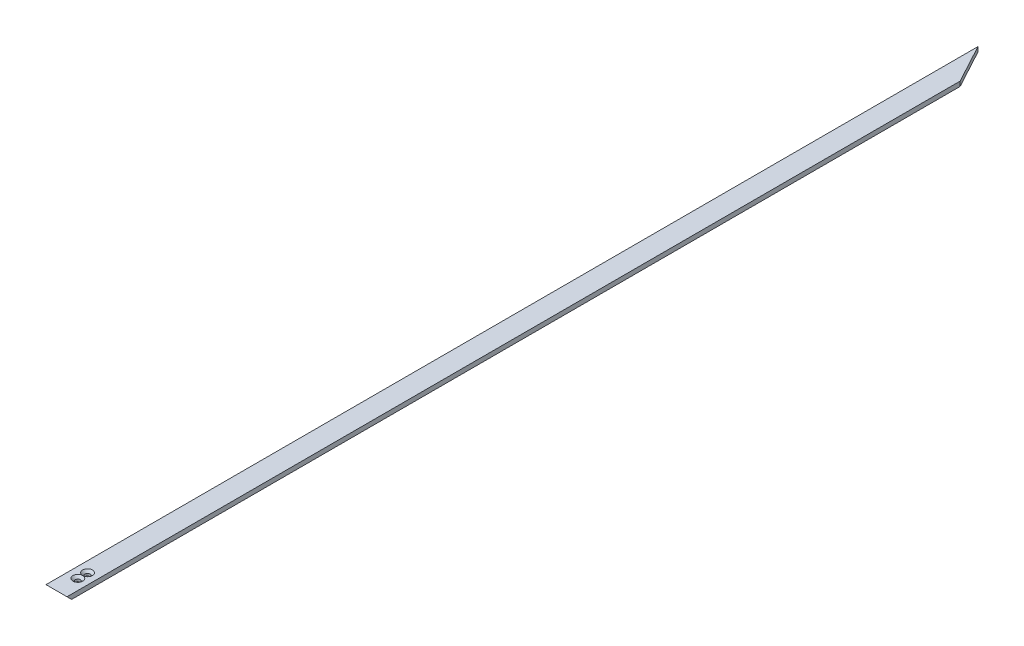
ISO-10303-21;
HEADER;
FILE_DESCRIPTION(('STEP AP214'),'2;1');
FILE_NAME('part.step','',(''),(''),'','','');
FILE_SCHEMA(('AUTOMOTIVE_DESIGN { 1 0 10303 214 1 1 1 1 }'));
ENDSEC;
DATA;
#1=APPLICATION_CONTEXT('core data for automotive mechanical design processes');
#2=APPLICATION_PROTOCOL_DEFINITION('international standard','automotive_design',2000,#1);
#3=PRODUCT_CONTEXT('',#1,'mechanical');
#4=PRODUCT('Part','Part','',(#3));
#5=PRODUCT_RELATED_PRODUCT_CATEGORY('part','',(#4));
#6=PRODUCT_DEFINITION_FORMATION('','',#4);
#7=PRODUCT_DEFINITION_CONTEXT('part definition',#1,'design');
#8=PRODUCT_DEFINITION('design','',#6,#7);
#9=PRODUCT_DEFINITION_SHAPE('','',#8);
#10=(LENGTH_UNIT() NAMED_UNIT(*) SI_UNIT(.MILLI.,.METRE.));
#11=(NAMED_UNIT(*) PLANE_ANGLE_UNIT() SI_UNIT($,.RADIAN.));
#12=(NAMED_UNIT(*) SI_UNIT($,.STERADIAN.) SOLID_ANGLE_UNIT());
#13=UNCERTAINTY_MEASURE_WITH_UNIT(LENGTH_MEASURE(1.E-05),#10,'distance_accuracy_value','');
#14=(GEOMETRIC_REPRESENTATION_CONTEXT(3) GLOBAL_UNCERTAINTY_ASSIGNED_CONTEXT((#13)) GLOBAL_UNIT_ASSIGNED_CONTEXT((#10,
#11,#12)) REPRESENTATION_CONTEXT('',''));
#15=CARTESIAN_POINT('',(0.,0.,0.));
#16=DIRECTION('',(0.,0.,1.));
#17=DIRECTION('',(1.,0.,0.));
#18=AXIS2_PLACEMENT_3D('',#15,#16,#17);
#19=CARTESIAN_POINT('',(-13.5,0.,600.));
#20=DIRECTION('',(1.,0.,0.));
#21=DIRECTION('',(0.,0.,-1.));
#22=AXIS2_PLACEMENT_3D('',#19,#20,#21);
#23=PLANE('',#22);
#24=DIRECTION('',(0.,0.,-1.));
#25=VECTOR('',#24,1.);
#26=CARTESIAN_POINT('',(-13.5,0.,600.));
#27=LINE('',#26,#25);
#28=CARTESIAN_POINT('',(-13.5,0.,594.));
#29=VERTEX_POINT('',#28);
#30=CARTESIAN_POINT('',(-13.5,0.,-600.));
#31=VERTEX_POINT('',#30);
#32=EDGE_CURVE('E124',#29,#31,#27,.T.);
#33=ORIENTED_EDGE('',*,*,#32,.F.);
#34=DIRECTION('',(0.,-0.707106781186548,-0.707106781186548));
#35=VECTOR('',#34,1.);
#36=CARTESIAN_POINT('',(-13.5,6.00000000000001,600.));
#37=LINE('',#36,#35);
#38=CARTESIAN_POINT('',(-13.5,6.,600.));
#39=VERTEX_POINT('',#38);
#40=EDGE_CURVE('E133',#29,#39,#37,.F.);
#41=ORIENTED_EDGE('',*,*,#40,.T.);
#42=DIRECTION('',(0.,0.,-1.));
#43=VECTOR('',#42,1.);
#44=CARTESIAN_POINT('',(-13.5,6.,600.));
#45=LINE('',#44,#43);
#46=CARTESIAN_POINT('',(-13.5,6.,-600.));
#47=VERTEX_POINT('',#46);
#48=EDGE_CURVE('E113',#39,#47,#45,.T.);
#49=ORIENTED_EDGE('',*,*,#48,.T.);
#50=DIRECTION('',(0.,-1.,0.));
#51=VECTOR('',#50,1.);
#52=CARTESIAN_POINT('',(-13.5,0.,-600.));
#53=LINE('',#52,#51);
#54=EDGE_CURVE('E98',#47,#31,#53,.T.);
#55=ORIENTED_EDGE('',*,*,#54,.T.);
#56=EDGE_LOOP('',(#33,#41,#49,#55));
#57=FACE_BOUND('',#56,.T.);
#58=ADVANCED_FACE('F36',(#57),#23,.F.);
#59=CARTESIAN_POINT('',(-13.5,0.,600.));
#60=DIRECTION('',(0.,1.,0.));
#61=DIRECTION('',(0.,0.,1.));
#62=AXIS2_PLACEMENT_3D('',#59,#60,#61);
#63=PLANE('',#62);
#64=CARTESIAN_POINT('',(0.,0.,572.5));
#65=DIRECTION('',(0.,1.,0.));
#66=DIRECTION('',(0.,0.,1.));
#67=AXIS2_PLACEMENT_3D('',#64,#65,#66);
#68=CIRCLE('',#67,3.25);
#69=CARTESIAN_POINT('',(0.,0.,575.75));
#70=VERTEX_POINT('',#69);
#71=EDGE_CURVE('E179',#70,#70,#68,.T.);
#72=ORIENTED_EDGE('',*,*,#71,.T.);
#73=EDGE_LOOP('',(#72));
#74=FACE_BOUND('',#73,.T.);
#75=CARTESIAN_POINT('',(0.,0.,560.));
#76=DIRECTION('',(0.,1.,0.));
#77=DIRECTION('',(0.,0.,1.));
#78=AXIS2_PLACEMENT_3D('',#75,#76,#77);
#79=CIRCLE('',#78,3.25);
#80=CARTESIAN_POINT('',(0.,0.,563.25));
#81=VERTEX_POINT('',#80);
#82=EDGE_CURVE('E93',#81,#81,#79,.T.);
#83=ORIENTED_EDGE('',*,*,#82,.T.);
#84=EDGE_LOOP('',(#83));
#85=FACE_BOUND('',#84,.T.);
#86=ORIENTED_EDGE('',*,*,#32,.T.);
#87=DIRECTION('',(0.475148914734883,0.,0.879905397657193));
#88=VECTOR('',#87,1.);
#89=CARTESIAN_POINT('',(13.5,0.,-550.));
#90=LINE('',#89,#88);
#91=CARTESIAN_POINT('',(13.5000000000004,0.,-549.999999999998));
#92=VERTEX_POINT('',#91);
#93=EDGE_CURVE('E49',#31,#92,#90,.T.);
#94=ORIENTED_EDGE('',*,*,#93,.T.);
#95=DIRECTION('',(0.,0.,-1.));
#96=VECTOR('',#95,1.);
#97=CARTESIAN_POINT('',(13.5,0.,600.));
#98=LINE('',#97,#96);
#99=CARTESIAN_POINT('',(13.5,0.,594.));
#100=VERTEX_POINT('',#99);
#101=EDGE_CURVE('E121',#100,#92,#98,.T.);
#102=ORIENTED_EDGE('',*,*,#101,.F.);
#103=DIRECTION('',(-1.,0.,0.));
#104=VECTOR('',#103,1.);
#105=CARTESIAN_POINT('',(-13.5,0.,594.));
#106=LINE('',#105,#104);
#107=EDGE_CURVE('E130',#100,#29,#106,.T.);
#108=ORIENTED_EDGE('',*,*,#107,.T.);
#109=EDGE_LOOP('',(#86,#94,#102,#108));
#110=FACE_BOUND('',#109,.T.);
#111=ADVANCED_FACE('F156',(#74,#85,#110),#63,.F.);
#112=CARTESIAN_POINT('',(13.5,0.,600.));
#113=DIRECTION('',(-1.,0.,0.));
#114=DIRECTION('',(0.,0.,1.));
#115=AXIS2_PLACEMENT_3D('',#112,#113,#114);
#116=PLANE('',#115);
#117=ORIENTED_EDGE('',*,*,#101,.T.);
#118=DIRECTION('',(0.,1.,0.));
#119=VECTOR('',#118,1.);
#120=CARTESIAN_POINT('',(13.5,6.,-550.));
#121=LINE('',#120,#119);
#122=CARTESIAN_POINT('',(13.5000000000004,6.,-549.999999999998));
#123=VERTEX_POINT('',#122);
#124=EDGE_CURVE('E136',#92,#123,#121,.T.);
#125=ORIENTED_EDGE('',*,*,#124,.T.);
#126=DIRECTION('',(0.,0.,-1.));
#127=VECTOR('',#126,1.);
#128=CARTESIAN_POINT('',(13.5,6.,600.));
#129=LINE('',#128,#127);
#130=CARTESIAN_POINT('',(13.5,6.,600.));
#131=VERTEX_POINT('',#130);
#132=EDGE_CURVE('E117',#131,#123,#129,.T.);
#133=ORIENTED_EDGE('',*,*,#132,.F.);
#134=DIRECTION('',(0.,0.707106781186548,0.707106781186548));
#135=VECTOR('',#134,1.);
#136=CARTESIAN_POINT('',(13.5,6.00000000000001,600.));
#137=LINE('',#136,#135);
#138=EDGE_CURVE('E127',#131,#100,#137,.F.);
#139=ORIENTED_EDGE('',*,*,#138,.T.);
#140=EDGE_LOOP('',(#117,#125,#133,#139));
#141=FACE_BOUND('',#140,.T.);
#142=ADVANCED_FACE('F154',(#141),#116,.F.);
#143=CARTESIAN_POINT('',(-13.5,6.,600.));
#144=DIRECTION('',(0.,-1.,0.));
#145=DIRECTION('',(0.,0.,-1.));
#146=AXIS2_PLACEMENT_3D('',#143,#144,#145);
#147=PLANE('',#146);
#148=CARTESIAN_POINT('',(0.,6.,560.));
#149=DIRECTION('',(0.,1.,0.));
#150=DIRECTION('',(0.,0.,1.));
#151=AXIS2_PLACEMENT_3D('',#148,#149,#150);
#152=CIRCLE('',#151,6.3);
#153=CARTESIAN_POINT('',(0.792148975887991,6.,566.25));
#154=VERTEX_POINT('',#153);
#155=CARTESIAN_POINT('',(-0.792148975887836,6.,566.25));
#156=VERTEX_POINT('',#155);
#157=EDGE_CURVE('E91',#154,#156,#152,.T.);
#158=ORIENTED_EDGE('',*,*,#157,.F.);
#159=CARTESIAN_POINT('',(0.,6.,572.5));
#160=DIRECTION('',(0.,1.,0.));
#161=DIRECTION('',(0.,0.,1.));
#162=AXIS2_PLACEMENT_3D('',#159,#160,#161);
#163=CIRCLE('',#162,6.3);
#164=EDGE_CURVE('E55',#156,#154,#163,.T.);
#165=ORIENTED_EDGE('',*,*,#164,.F.);
#166=EDGE_LOOP('',(#158,#165));
#167=FACE_BOUND('',#166,.T.);
#168=ORIENTED_EDGE('',*,*,#132,.T.);
#169=DIRECTION('',(-0.475148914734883,0.,-0.879905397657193));
#170=VECTOR('',#169,1.);
#171=CARTESIAN_POINT('',(13.5,6.,-550.));
#172=LINE('',#171,#170);
#173=EDGE_CURVE('E140',#123,#47,#172,.T.);
#174=ORIENTED_EDGE('',*,*,#173,.T.);
#175=ORIENTED_EDGE('',*,*,#48,.F.);
#176=DIRECTION('',(-1.,0.,0.));
#177=VECTOR('',#176,1.);
#178=CARTESIAN_POINT('',(-13.5,6.,600.));
#179=LINE('',#178,#177);
#180=EDGE_CURVE('E105',#131,#39,#179,.T.);
#181=ORIENTED_EDGE('',*,*,#180,.F.);
#182=EDGE_LOOP('',(#168,#174,#175,#181));
#183=FACE_BOUND('',#182,.T.);
#184=ADVANCED_FACE('F89',(#167,#183),#147,.F.);
#185=CARTESIAN_POINT('',(-13.5,6.00000000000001,600.));
#186=DIRECTION('',(0.,0.707106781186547,-0.707106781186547));
#187=DIRECTION('',(0.,0.707106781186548,0.707106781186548));
#188=AXIS2_PLACEMENT_3D('',#185,#186,#187);
#189=PLANE('',#188);
#190=ORIENTED_EDGE('',*,*,#40,.F.);
#191=ORIENTED_EDGE('',*,*,#107,.F.);
#192=ORIENTED_EDGE('',*,*,#138,.F.);
#193=ORIENTED_EDGE('',*,*,#180,.T.);
#194=EDGE_LOOP('',(#190,#191,#192,#193));
#195=FACE_BOUND('',#194,.T.);
#196=ADVANCED_FACE('F158',(#195),#189,.F.);
#197=CARTESIAN_POINT('',(13.5,0.,-550.));
#198=DIRECTION('',(0.879905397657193,0.,-0.475148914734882));
#199=DIRECTION('',(-0.475148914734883,0.,-0.879905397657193));
#200=AXIS2_PLACEMENT_3D('',#197,#198,#199);
#201=PLANE('',#200);
#202=ORIENTED_EDGE('',*,*,#93,.F.);
#203=ORIENTED_EDGE('',*,*,#54,.F.);
#204=ORIENTED_EDGE('',*,*,#173,.F.);
#205=ORIENTED_EDGE('',*,*,#124,.F.);
#206=EDGE_LOOP('',(#202,#203,#204,#205));
#207=FACE_BOUND('',#206,.T.);
#208=ADVANCED_FACE('F152',(#207),#201,.T.);
#209=CARTESIAN_POINT('',(0.,6.,560.));
#210=DIRECTION('',(0.,1.,0.));
#211=DIRECTION('',(0.,0.,1.));
#212=AXIS2_PLACEMENT_3D('',#209,#210,#211);
#213=CONICAL_SURFACE('',#212,6.3,0.785398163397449);
#214=CARTESIAN_POINT('',(0.,2.95,560.));
#215=DIRECTION('',(0.,1.,0.));
#216=DIRECTION('',(0.,0.,1.));
#217=AXIS2_PLACEMENT_3D('',#214,#215,#216);
#218=CIRCLE('',#217,3.25);
#219=CARTESIAN_POINT('',(0.,2.95,563.25));
#220=VERTEX_POINT('',#219);
#221=EDGE_CURVE('E99',#220,#220,#218,.T.);
#222=ORIENTED_EDGE('',*,*,#221,.F.);
#223=EDGE_LOOP('',(#222));
#224=FACE_BOUND('',#223,.T.);
#225=ORIENTED_EDGE('',*,*,#157,.T.);
#226=CARTESIAN_POINT('',(-0.793738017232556,6.0002,566.25));
#227=CARTESIAN_POINT('',(-0.661886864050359,5.98355046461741,566.25));
#228=CARTESIAN_POINT('',(-0.529508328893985,5.97098359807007,566.25));
#229=CARTESIAN_POINT('',(-0.264751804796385,5.95422490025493,566.25));
#230=CARTESIAN_POINT('',(-0.132375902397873,5.94999999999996,566.25));
#231=CARTESIAN_POINT('',(0.13237590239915,5.94999999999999,566.25));
#232=CARTESIAN_POINT('',(0.264751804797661,5.95422490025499,566.25));
#233=CARTESIAN_POINT('',(0.529508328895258,5.97098359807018,566.25));
#234=CARTESIAN_POINT('',(0.661886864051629,5.98355046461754,566.25));
#235=CARTESIAN_POINT('',(0.793738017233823,6.00020000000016,566.25));
#236=B_SPLINE_CURVE_WITH_KNOTS('',3,(#226,#227,#228,#229,#230,#231,#232,#233,#234,#235),
.UNSPECIFIED.,.F.,.F.,(4,2,2,2,4),(0.,0.398649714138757,0.79571591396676,1.19278211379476,
1.59143182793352),.UNSPECIFIED.);
#237=EDGE_CURVE('E11',#156,#154,#236,.T.);
#238=ORIENTED_EDGE('',*,*,#237,.T.);
#239=EDGE_LOOP('',(#225,#238));
#240=FACE_BOUND('',#239,.T.);
#241=ADVANCED_FACE('F96',(#224,#240),#213,.F.);
#242=CARTESIAN_POINT('',(0.,6.,560.));
#243=DIRECTION('',(0.,1.,0.));
#244=DIRECTION('',(0.,0.,1.));
#245=AXIS2_PLACEMENT_3D('',#242,#243,#244);
#246=CYLINDRICAL_SURFACE('',#245,3.25);
#247=ORIENTED_EDGE('',*,*,#82,.F.);
#248=EDGE_LOOP('',(#247));
#249=FACE_BOUND('',#248,.T.);
#250=ORIENTED_EDGE('',*,*,#221,.T.);
#251=EDGE_LOOP('',(#250));
#252=FACE_BOUND('',#251,.T.);
#253=ADVANCED_FACE('F194',(#249,#252),#246,.F.);
#254=CARTESIAN_POINT('',(0.,6.,572.5));
#255=DIRECTION('',(0.,1.,0.));
#256=DIRECTION('',(0.,0.,1.));
#257=AXIS2_PLACEMENT_3D('',#254,#255,#256);
#258=CONICAL_SURFACE('',#257,6.3,0.785398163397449);
#259=CARTESIAN_POINT('',(0.,2.95,572.5));
#260=DIRECTION('',(0.,1.,0.));
#261=DIRECTION('',(0.,0.,1.));
#262=AXIS2_PLACEMENT_3D('',#259,#260,#261);
#263=CIRCLE('',#262,3.25);
#264=CARTESIAN_POINT('',(0.,2.95,575.75));
#265=VERTEX_POINT('',#264);
#266=EDGE_CURVE('E94',#265,#265,#263,.T.);
#267=ORIENTED_EDGE('',*,*,#266,.F.);
#268=EDGE_LOOP('',(#267));
#269=FACE_BOUND('',#268,.T.);
#270=ORIENTED_EDGE('',*,*,#164,.T.);
#271=ORIENTED_EDGE('',*,*,#237,.F.);
#272=EDGE_LOOP('',(#270,#271));
#273=FACE_BOUND('',#272,.T.);
#274=ADVANCED_FACE('F84',(#269,#273),#258,.F.);
#275=CARTESIAN_POINT('',(0.,6.,572.5));
#276=DIRECTION('',(0.,1.,0.));
#277=DIRECTION('',(0.,0.,1.));
#278=AXIS2_PLACEMENT_3D('',#275,#276,#277);
#279=CYLINDRICAL_SURFACE('',#278,3.25);
#280=ORIENTED_EDGE('',*,*,#71,.F.);
#281=EDGE_LOOP('',(#280));
#282=FACE_BOUND('',#281,.T.);
#283=ORIENTED_EDGE('',*,*,#266,.T.);
#284=EDGE_LOOP('',(#283));
#285=FACE_BOUND('',#284,.T.);
#286=ADVANCED_FACE('F191',(#282,#285),#279,.F.);
#287=CLOSED_SHELL('',(#58,#111,#142,#184,#196,#208,#241,#253,#274,#286));
#288=MANIFOLD_SOLID_BREP('B2',#287);
#289=ADVANCED_BREP_SHAPE_REPRESENTATION('',(#18,#288),#14);
#290=SHAPE_DEFINITION_REPRESENTATION(#9,#289);
ENDSEC;
END-ISO-10303-21;
